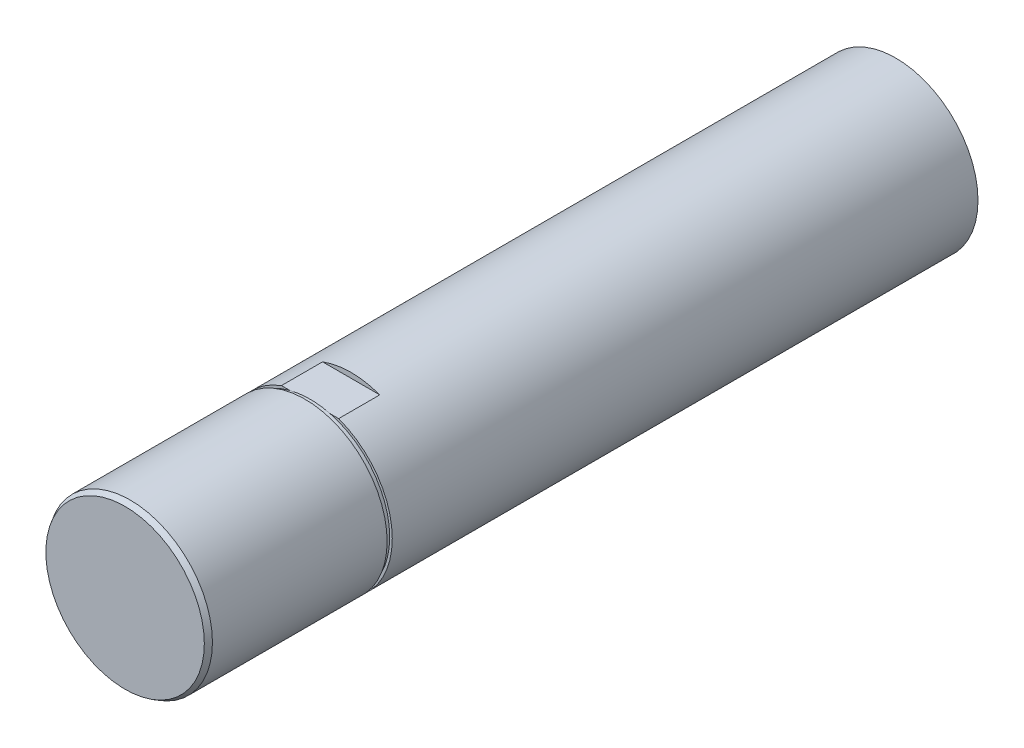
from build123d import *

# Parameters (mm, degrees)
SKETCH1_R        = 16
STROKE_DEPTH     = 100
EXTRUDE_START    = 14
SKETCH2_R        = 16
EXTRUDE_L2_DEPTH = 14
EXTRUDE_START_2  = 36
SKETCH3_R        = 16
EXTRUDE_L3_DEPTH = 36
CHAMFER2_SIZE    = 1
CHAMFER2_SIZE2   = 0.577350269
U_C_START        = 1
SKETCH5_R        = 16
SKETCH5_R_2      = 15.5
U_C_DEPTH        = 1
SKETCH6_W        = 8
SKETCH6_H        = 1.5
A_F_DEPTH        = 10.5


with BuildPart() as part:
    # Sketch1 → STROKE (new body)
    with BuildSketch(Plane.XY):
        Circle(SKETCH1_R)
    extrude(amount=-STROKE_DEPTH)

    # Sketch2 → Extrude L2 (add)
    with BuildSketch(Plane.XY.offset(EXTRUDE_START)):
        Circle(SKETCH2_R)
    extrude(amount=-EXTRUDE_L2_DEPTH)

    # Sketch3 → Extrude L3 (add)
    with BuildSketch(Plane.XY.offset(14).offset(EXTRUDE_START_2)):
        Circle(SKETCH3_R)
    extrude(amount=-EXTRUDE_L3_DEPTH)

    # Chamfer2
    chamfer2_edges = [part.edges().sort_by_distance(p)[0] for p in [
        (-16, 0, 50),
    ]]
    chamfer2_side = [part.faces().sort_by_distance(p)[0] for p in [
        (-16, 0, -25),
    ]]
    chamfer(chamfer2_edges, length=CHAMFER2_SIZE, length2=CHAMFER2_SIZE2, reference=chamfer2_side[0])

    # Sketch5 → U_C (cut)
    with BuildSketch(Plane.XY.offset(14).offset(U_C_START)):
        Circle(SKETCH5_R)
        Circle(SKETCH5_R_2, mode=Mode.SUBTRACT)
    extrude(amount=-U_C_DEPTH, mode=Mode.SUBTRACT)

    # Sketch6 → A_F (cut, symmetric)
    with BuildSketch(Plane(origin=(0, 0, 0), x_dir=(0, 0, -1), z_dir=(1, 0, 0))):
        with Locations((-10, 15.75)):
            Rectangle(SKETCH6_W, SKETCH6_H)
        with Locations((-10, -15.75)):
            Rectangle(SKETCH6_W, SKETCH6_H)
    extrude(amount=A_F_DEPTH, both=True, mode=Mode.SUBTRACT)


solid = part.part
